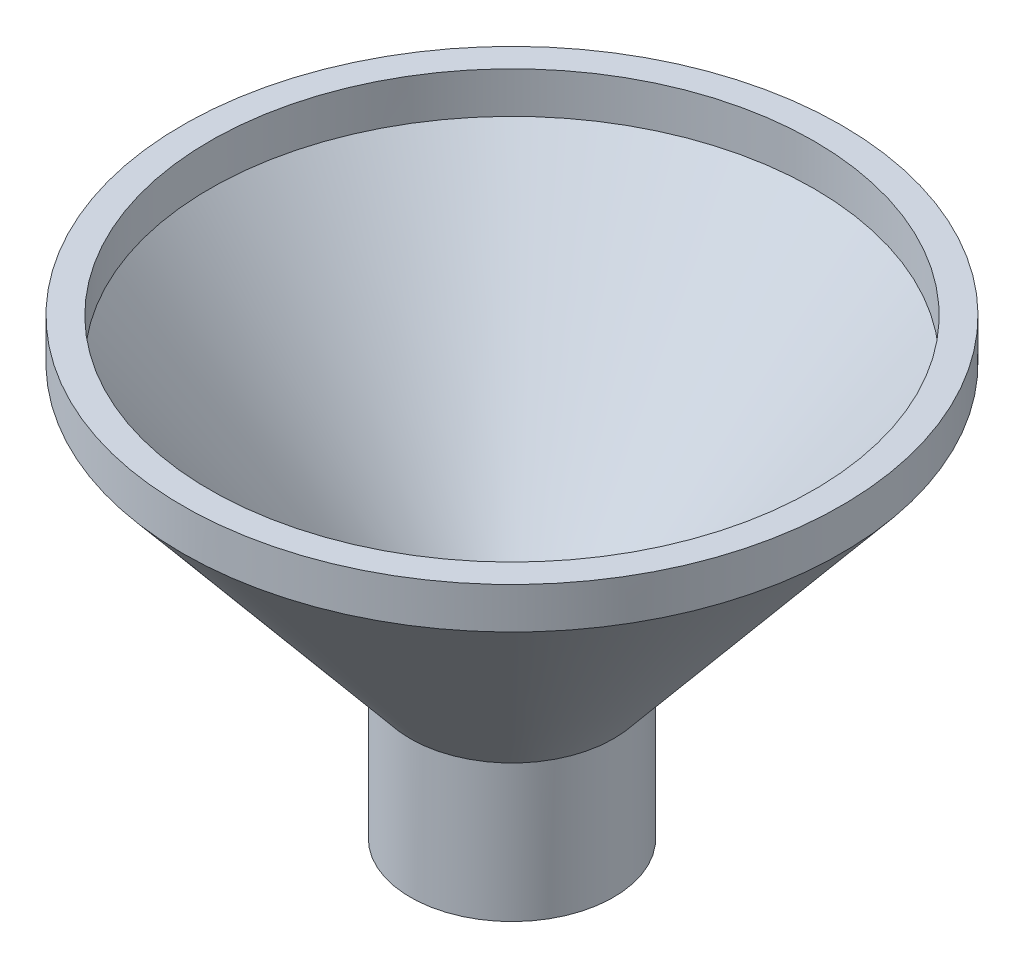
from build123d import *


with BuildPart() as part:
    # Sketch4 → Revolve-Thin1 (revolve)
    with BuildSketch(Plane.XY, mode=Mode.PRIVATE) as revolve_thin1_sk:
        Polygon((120, 150), (120, 165), (110, 165), (110, 150), (27, 50), (27, 0), (37, 0), (37, 50), align=None)
        Polygon((119, 150.360935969), (119, 164), (111, 164), (111, 149.639064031), (28, 49.639064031), (28, 1), (36, 1), (36, 50.360935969), align=None, mode=Mode.SUBTRACT)
    revolve(revolve_thin1_sk.sketch.rotate(Axis((0, 0, 0), (0, 1, 0)), 90), axis=Axis((0, 0, 0), (0, 1, 0)))


solid = part.part
